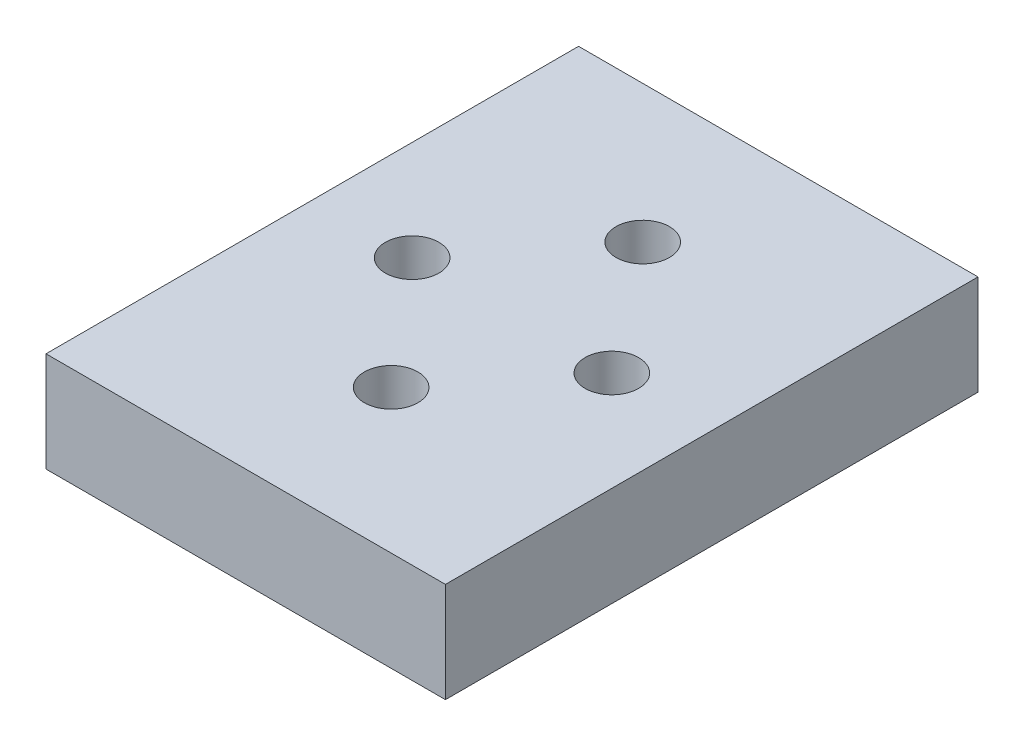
from build123d import *

# Parameters (mm, degrees)
SKETCH1_W                                       = 38.1
SKETCH1_H                                       = 50.8
BOSS_EXTRUDE1_DEPTH                             = 4.7625
CBORE_FOR_10_SOCKET_HEAD_CAP_SCREW1_D           = 5.1054
CBORE_FOR_10_SOCKET_HEAD_CAP_SCREW1_CBORE_D     = 9.525
CBORE_FOR_10_SOCKET_HEAD_CAP_SCREW1_CBORE_DEPTH = 4.826
F_1_4_20_TAPPED_HOLE1_D                         = 5.1054


with BuildPart() as part:
    # Sketch1 → Boss-Extrude1 (new, symmetric)
    with BuildSketch(Plane(origin=(0, 0, 0), x_dir=(1, 0, 0), z_dir=(0, 1, 0))):
        Rectangle(SKETCH1_W, SKETCH1_H)
    extrude(amount=BOSS_EXTRUDE1_DEPTH, both=True)

    # CBORE for _10 Socket Head Cap Screw1 (through all)
    with Locations(Plane(origin=(0, -4.7625, 0), x_dir=(-1, 0, 0), z_dir=(0, -1, 0))):
        with Locations((-9.525, 0), (9.525, 0)):
            CounterBoreHole(CBORE_FOR_10_SOCKET_HEAD_CAP_SCREW1_D / 2, CBORE_FOR_10_SOCKET_HEAD_CAP_SCREW1_CBORE_D / 2, CBORE_FOR_10_SOCKET_HEAD_CAP_SCREW1_CBORE_DEPTH)

    # 1_4-20 Tapped Hole1 (through all)
    with Locations(Plane(origin=(0, -4.7625, 0), x_dir=(-1, 0, 0), z_dir=(0, -1, 0))):
        with Locations((-0.1814, -11.71111396), (-0.1814, 12.28888604)):
            Hole(F_1_4_20_TAPPED_HOLE1_D / 2)


solid = part.part
